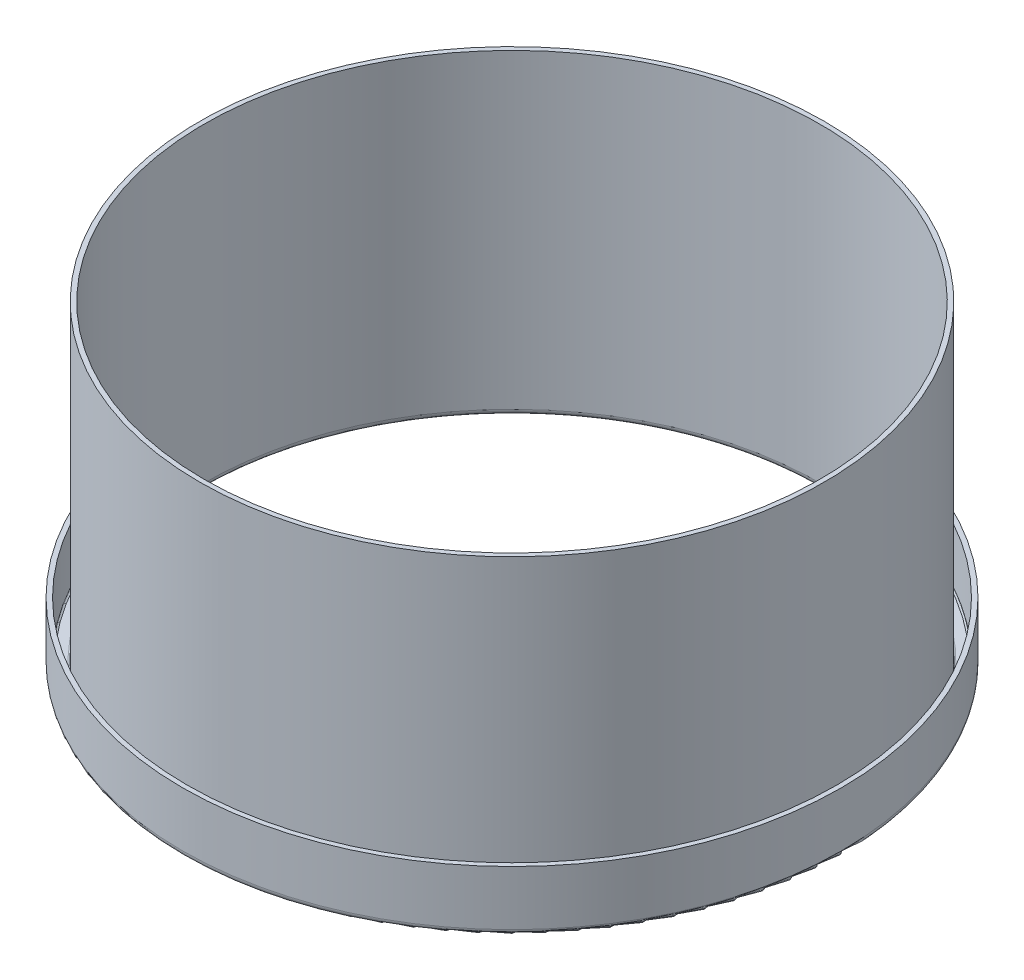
ISO-10303-21;
HEADER;
FILE_DESCRIPTION(('STEP AP214'),'2;1');
FILE_NAME('part.step','',(''),(''),'','','');
FILE_SCHEMA(('AUTOMOTIVE_DESIGN { 1 0 10303 214 1 1 1 1 }'));
ENDSEC;
DATA;
#1=APPLICATION_CONTEXT('core data for automotive mechanical design processes');
#2=APPLICATION_PROTOCOL_DEFINITION('international standard','automotive_design',2000,#1);
#3=PRODUCT_CONTEXT('',#1,'mechanical');
#4=PRODUCT('Part','Part','',(#3));
#5=PRODUCT_RELATED_PRODUCT_CATEGORY('part','',(#4));
#6=PRODUCT_DEFINITION_FORMATION('','',#4);
#7=PRODUCT_DEFINITION_CONTEXT('part definition',#1,'design');
#8=PRODUCT_DEFINITION('design','',#6,#7);
#9=PRODUCT_DEFINITION_SHAPE('','',#8);
#10=(LENGTH_UNIT() NAMED_UNIT(*) SI_UNIT(.MILLI.,.METRE.));
#11=(NAMED_UNIT(*) PLANE_ANGLE_UNIT() SI_UNIT($,.RADIAN.));
#12=(NAMED_UNIT(*) SI_UNIT($,.STERADIAN.) SOLID_ANGLE_UNIT());
#13=UNCERTAINTY_MEASURE_WITH_UNIT(LENGTH_MEASURE(1.E-05),#10,'distance_accuracy_value','');
#14=(GEOMETRIC_REPRESENTATION_CONTEXT(3) GLOBAL_UNCERTAINTY_ASSIGNED_CONTEXT((#13)) GLOBAL_UNIT_ASSIGNED_CONTEXT((#10,
#11,#12)) REPRESENTATION_CONTEXT('',''));
#15=CARTESIAN_POINT('',(0.,0.,0.));
#16=DIRECTION('',(0.,0.,1.));
#17=DIRECTION('',(1.,0.,0.));
#18=AXIS2_PLACEMENT_3D('',#15,#16,#17);
#19=CARTESIAN_POINT('',(0.,0.7366,0.));
#20=DIRECTION('',(0.,1.,0.));
#21=DIRECTION('',(0.,0.,1.));
#22=AXIS2_PLACEMENT_3D('',#19,#20,#21);
#23=PLANE('',#22);
#24=CARTESIAN_POINT('',(0.,0.7366,0.));
#25=DIRECTION('',(0.,1.,0.));
#26=DIRECTION('',(0.,0.,1.));
#27=AXIS2_PLACEMENT_3D('',#24,#25,#26);
#28=CIRCLE('',#27,50.25);
#29=CARTESIAN_POINT('',(0.,0.7366,50.25));
#30=VERTEX_POINT('',#29);
#31=EDGE_CURVE('E146',#30,#30,#28,.T.);
#32=ORIENTED_EDGE('',*,*,#31,.F.);
#33=EDGE_LOOP('',(#32));
#34=FACE_BOUND('',#33,.T.);
#35=CARTESIAN_POINT('',(0.,0.7366,0.));
#36=DIRECTION('',(0.,1.,0.));
#37=DIRECTION('',(0.,0.,1.));
#38=AXIS2_PLACEMENT_3D('',#35,#36,#37);
#39=CIRCLE('',#38,51.75);
#40=CARTESIAN_POINT('',(0.,0.7366,51.75));
#41=VERTEX_POINT('',#40);
#42=EDGE_CURVE('E196',#41,#41,#39,.T.);
#43=ORIENTED_EDGE('',*,*,#42,.T.);
#44=EDGE_LOOP('',(#43));
#45=FACE_BOUND('',#44,.T.);
#46=ADVANCED_FACE('F137',(#34,#45),#23,.T.);
#47=CARTESIAN_POINT('',(0.,0.,0.));
#48=DIRECTION('',(0.,1.,0.));
#49=DIRECTION('',(0.,0.,1.));
#50=AXIS2_PLACEMENT_3D('',#47,#48,#49);
#51=PLANE('',#50);
#52=CARTESIAN_POINT('',(0.,0.,0.));
#53=DIRECTION('',(0.,1.,0.));
#54=DIRECTION('',(0.,0.,1.));
#55=AXIS2_PLACEMENT_3D('',#52,#53,#54);
#56=CIRCLE('',#55,50.25);
#57=CARTESIAN_POINT('',(0.,0.,50.25));
#58=VERTEX_POINT('',#57);
#59=EDGE_CURVE('E221',#58,#58,#56,.T.);
#60=ORIENTED_EDGE('',*,*,#59,.T.);
#61=EDGE_LOOP('',(#60));
#62=FACE_BOUND('',#61,.T.);
#63=CARTESIAN_POINT('',(0.,0.,0.));
#64=DIRECTION('',(0.,1.,0.));
#65=DIRECTION('',(0.,0.,1.));
#66=AXIS2_PLACEMENT_3D('',#63,#64,#65);
#67=CIRCLE('',#66,51.75);
#68=CARTESIAN_POINT('',(0.,0.,51.75));
#69=VERTEX_POINT('',#68);
#70=EDGE_CURVE('E12',#69,#69,#67,.T.);
#71=ORIENTED_EDGE('',*,*,#70,.F.);
#72=EDGE_LOOP('',(#71));
#73=FACE_BOUND('',#72,.T.);
#74=ADVANCED_FACE('F139',(#62,#73),#51,.F.);
#75=CARTESIAN_POINT('',(0.,50.7366,0.));
#76=DIRECTION('',(0.,-1.,0.));
#77=DIRECTION('',(0.,0.,-1.));
#78=AXIS2_PLACEMENT_3D('',#75,#76,#77);
#79=PLANE('',#78);
#80=CARTESIAN_POINT('',(0.,50.7366,0.));
#81=DIRECTION('',(0.,1.,0.));
#82=DIRECTION('',(0.,0.,1.));
#83=AXIS2_PLACEMENT_3D('',#80,#81,#82);
#84=CIRCLE('',#83,50.0000000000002);
#85=CARTESIAN_POINT('',(0.,50.7366,50.0000000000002));
#86=VERTEX_POINT('',#85);
#87=EDGE_CURVE('E231',#86,#86,#84,.T.);
#88=ORIENTED_EDGE('',*,*,#87,.T.);
#89=EDGE_LOOP('',(#88));
#90=FACE_BOUND('',#89,.T.);
#91=CARTESIAN_POINT('',(0.,50.7366,0.));
#92=DIRECTION('',(0.,1.,0.));
#93=DIRECTION('',(0.,0.,1.));
#94=AXIS2_PLACEMENT_3D('',#91,#92,#93);
#95=CIRCLE('',#94,49.2634000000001);
#96=CARTESIAN_POINT('',(0.,50.7366,49.2634000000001));
#97=VERTEX_POINT('',#96);
#98=EDGE_CURVE('E224',#97,#97,#95,.T.);
#99=ORIENTED_EDGE('',*,*,#98,.F.);
#100=EDGE_LOOP('',(#99));
#101=FACE_BOUND('',#100,.T.);
#102=ADVANCED_FACE('F289',(#90,#101),#79,.F.);
#103=CARTESIAN_POINT('',(0.,0.7366,0.));
#104=DIRECTION('',(0.,1.,0.));
#105=DIRECTION('',(0.,0.,1.));
#106=AXIS2_PLACEMENT_3D('',#103,#104,#105);
#107=CYLINDRICAL_SURFACE('',#106,49.2634000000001);
#108=DIRECTION('',(0.,1.,0.));
#109=VECTOR('',#108,1.);
#110=CARTESIAN_POINT('',(0.,0.7366,49.2634000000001));
#111=LINE('',#110,#109);
#112=CARTESIAN_POINT('',(0.,0.986600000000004,49.2634));
#113=VERTEX_POINT('',#112);
#114=EDGE_CURVE('E218',#113,#97,#111,.T.);
#115=ORIENTED_EDGE('',*,*,#114,.F.);
#116=CARTESIAN_POINT('',(0.,0.986600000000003,0.));
#117=DIRECTION('',(0.,1.,0.));
#118=DIRECTION('',(0.,0.,1.));
#119=AXIS2_PLACEMENT_3D('',#116,#117,#118);
#120=CIRCLE('',#119,49.2634);
#121=EDGE_CURVE('E222',#113,#113,#120,.T.);
#122=ORIENTED_EDGE('',*,*,#121,.F.);
#123=ORIENTED_EDGE('',*,*,#114,.T.);
#124=ORIENTED_EDGE('',*,*,#98,.T.);
#125=EDGE_LOOP('',(#115,#122,#123,#124));
#126=FACE_BOUND('',#125,.T.);
#127=ADVANCED_FACE('F296',(#126),#107,.F.);
#128=CARTESIAN_POINT('',(0.,0.9866,0.));
#129=DIRECTION('',(0.,1.,0.));
#130=DIRECTION('',(0.,0.,1.));
#131=AXIS2_PLACEMENT_3D('',#128,#129,#130);
#132=TOROIDAL_SURFACE('',#131,50.25,0.9866);
#133=CARTESIAN_POINT('',(0.,0.9866,50.25));
#134=DIRECTION('',(-1.,0.,0.));
#135=DIRECTION('',(0.,0.,1.));
#136=AXIS2_PLACEMENT_3D('',#133,#134,#135);
#137=CIRCLE('',#136,0.9866);
#138=EDGE_CURVE('E161',#58,#113,#137,.F.);
#139=ORIENTED_EDGE('',*,*,#138,.F.);
#140=ORIENTED_EDGE('',*,*,#59,.F.);
#141=ORIENTED_EDGE('',*,*,#138,.T.);
#142=ORIENTED_EDGE('',*,*,#121,.T.);
#143=EDGE_LOOP('',(#139,#140,#141,#142));
#144=FACE_BOUND('',#143,.T.);
#145=ADVANCED_FACE('F291',(#144),#132,.T.);
#146=CARTESIAN_POINT('',(0.,0.7366,0.));
#147=DIRECTION('',(0.,1.,0.));
#148=DIRECTION('',(0.,0.,1.));
#149=AXIS2_PLACEMENT_3D('',#146,#147,#148);
#150=CYLINDRICAL_SURFACE('',#149,50.0000000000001);
#151=DIRECTION('',(0.,1.,0.));
#152=VECTOR('',#151,1.);
#153=CARTESIAN_POINT('',(0.,0.7366,50.));
#154=LINE('',#153,#152);
#155=CARTESIAN_POINT('',(0.,0.986600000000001,50.));
#156=VERTEX_POINT('',#155);
#157=EDGE_CURVE('E232',#156,#86,#154,.T.);
#158=ORIENTED_EDGE('',*,*,#157,.T.);
#159=ORIENTED_EDGE('',*,*,#87,.F.);
#160=ORIENTED_EDGE('',*,*,#157,.F.);
#161=CARTESIAN_POINT('',(0.,0.986600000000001,0.));
#162=DIRECTION('',(0.,1.,0.));
#163=DIRECTION('',(0.,0.,1.));
#164=AXIS2_PLACEMENT_3D('',#161,#162,#163);
#165=CIRCLE('',#164,50.);
#166=EDGE_CURVE('E228',#156,#156,#165,.T.);
#167=ORIENTED_EDGE('',*,*,#166,.T.);
#168=EDGE_LOOP('',(#158,#159,#160,#167));
#169=FACE_BOUND('',#168,.T.);
#170=ADVANCED_FACE('F281',(#169),#150,.T.);
#171=CARTESIAN_POINT('',(0.,0.9866,0.));
#172=DIRECTION('',(0.,1.,0.));
#173=DIRECTION('',(0.,0.,1.));
#174=AXIS2_PLACEMENT_3D('',#171,#172,#173);
#175=TOROIDAL_SURFACE('',#174,50.25,0.25);
#176=CARTESIAN_POINT('',(0.,0.9866,50.25));
#177=DIRECTION('',(-1.,0.,0.));
#178=DIRECTION('',(0.,-1.,0.));
#179=AXIS2_PLACEMENT_3D('',#176,#177,#178);
#180=CIRCLE('',#179,0.25);
#181=EDGE_CURVE('E217',#30,#156,#180,.F.);
#182=ORIENTED_EDGE('',*,*,#181,.T.);
#183=ORIENTED_EDGE('',*,*,#166,.F.);
#184=ORIENTED_EDGE('',*,*,#181,.F.);
#185=ORIENTED_EDGE('',*,*,#31,.T.);
#186=EDGE_LOOP('',(#182,#183,#184,#185));
#187=FACE_BOUND('',#186,.T.);
#188=ADVANCED_FACE('F272',(#187),#175,.F.);
#189=CARTESIAN_POINT('',(0.,9.73659999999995,0.));
#190=DIRECTION('',(0.,-1.,0.));
#191=DIRECTION('',(0.,0.,-1.));
#192=AXIS2_PLACEMENT_3D('',#189,#190,#191);
#193=PLANE('',#192);
#194=CARTESIAN_POINT('',(0.,9.73659999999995,0.));
#195=DIRECTION('',(0.,1.,0.));
#196=DIRECTION('',(0.,0.,1.));
#197=AXIS2_PLACEMENT_3D('',#194,#195,#196);
#198=CIRCLE('',#197,52.7366);
#199=CARTESIAN_POINT('',(0.,9.73659999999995,52.7366));
#200=VERTEX_POINT('',#199);
#201=EDGE_CURVE('E213',#200,#200,#198,.T.);
#202=ORIENTED_EDGE('',*,*,#201,.T.);
#203=EDGE_LOOP('',(#202));
#204=FACE_BOUND('',#203,.T.);
#205=CARTESIAN_POINT('',(0.,9.73659999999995,0.));
#206=DIRECTION('',(0.,1.,0.));
#207=DIRECTION('',(0.,0.,1.));
#208=AXIS2_PLACEMENT_3D('',#205,#206,#207);
#209=CIRCLE('',#208,52.);
#210=CARTESIAN_POINT('',(0.,9.73659999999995,52.));
#211=VERTEX_POINT('',#210);
#212=EDGE_CURVE('E195',#211,#211,#209,.T.);
#213=ORIENTED_EDGE('',*,*,#212,.F.);
#214=EDGE_LOOP('',(#213));
#215=FACE_BOUND('',#214,.T.);
#216=ADVANCED_FACE('F267',(#204,#215),#193,.F.);
#217=CARTESIAN_POINT('',(0.,0.7366,0.));
#218=DIRECTION('',(0.,1.,0.));
#219=DIRECTION('',(0.,0.,1.));
#220=AXIS2_PLACEMENT_3D('',#217,#218,#219);
#221=CYLINDRICAL_SURFACE('',#220,52.);
#222=DIRECTION('',(0.,1.,0.));
#223=VECTOR('',#222,1.);
#224=CARTESIAN_POINT('',(0.,0.7366,52.));
#225=LINE('',#224,#223);
#226=CARTESIAN_POINT('',(0.,0.986600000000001,52.));
#227=VERTEX_POINT('',#226);
#228=EDGE_CURVE('E202',#227,#211,#225,.T.);
#229=ORIENTED_EDGE('',*,*,#228,.F.);
#230=CARTESIAN_POINT('',(0.,0.986600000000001,0.));
#231=DIRECTION('',(0.,1.,0.));
#232=DIRECTION('',(0.,0.,1.));
#233=AXIS2_PLACEMENT_3D('',#230,#231,#232);
#234=CIRCLE('',#233,52.);
#235=EDGE_CURVE('E190',#227,#227,#234,.T.);
#236=ORIENTED_EDGE('',*,*,#235,.F.);
#237=ORIENTED_EDGE('',*,*,#228,.T.);
#238=ORIENTED_EDGE('',*,*,#212,.T.);
#239=EDGE_LOOP('',(#229,#236,#237,#238));
#240=FACE_BOUND('',#239,.T.);
#241=ADVANCED_FACE('F269',(#240),#221,.F.);
#242=CARTESIAN_POINT('',(0.,0.9866,0.));
#243=DIRECTION('',(0.,1.,0.));
#244=DIRECTION('',(0.,0.,1.));
#245=AXIS2_PLACEMENT_3D('',#242,#243,#244);
#246=TOROIDAL_SURFACE('',#245,51.75,0.25);
#247=CARTESIAN_POINT('',(0.,0.9866,51.75));
#248=DIRECTION('',(1.,0.,0.));
#249=DIRECTION('',(0.,1.,0.));
#250=AXIS2_PLACEMENT_3D('',#247,#248,#249);
#251=CIRCLE('',#250,0.25);
#252=EDGE_CURVE('E154',#41,#227,#251,.F.);
#253=ORIENTED_EDGE('',*,*,#252,.F.);
#254=ORIENTED_EDGE('',*,*,#42,.F.);
#255=ORIENTED_EDGE('',*,*,#252,.T.);
#256=ORIENTED_EDGE('',*,*,#235,.T.);
#257=EDGE_LOOP('',(#253,#254,#255,#256));
#258=FACE_BOUND('',#257,.T.);
#259=ADVANCED_FACE('F191',(#258),#246,.F.);
#260=CARTESIAN_POINT('',(0.,0.7366,0.));
#261=DIRECTION('',(0.,1.,0.));
#262=DIRECTION('',(0.,0.,1.));
#263=AXIS2_PLACEMENT_3D('',#260,#261,#262);
#264=CYLINDRICAL_SURFACE('',#263,52.7366);
#265=DIRECTION('',(0.,1.,0.));
#266=VECTOR('',#265,1.);
#267=CARTESIAN_POINT('',(0.,0.7366,52.7366));
#268=LINE('',#267,#266);
#269=CARTESIAN_POINT('',(0.,0.986600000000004,52.7366));
#270=VERTEX_POINT('',#269);
#271=EDGE_CURVE('E206',#270,#200,#268,.T.);
#272=ORIENTED_EDGE('',*,*,#271,.T.);
#273=ORIENTED_EDGE('',*,*,#201,.F.);
#274=ORIENTED_EDGE('',*,*,#271,.F.);
#275=CARTESIAN_POINT('',(0.,0.986600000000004,0.));
#276=DIRECTION('',(0.,1.,0.));
#277=DIRECTION('',(0.,0.,1.));
#278=AXIS2_PLACEMENT_3D('',#275,#276,#277);
#279=CIRCLE('',#278,52.7366);
#280=EDGE_CURVE('E209',#270,#270,#279,.T.);
#281=ORIENTED_EDGE('',*,*,#280,.T.);
#282=EDGE_LOOP('',(#272,#273,#274,#281));
#283=FACE_BOUND('',#282,.T.);
#284=ADVANCED_FACE('F264',(#283),#264,.T.);
#285=CARTESIAN_POINT('',(0.,0.9866,0.));
#286=DIRECTION('',(0.,1.,0.));
#287=DIRECTION('',(0.,0.,1.));
#288=AXIS2_PLACEMENT_3D('',#285,#286,#287);
#289=TOROIDAL_SURFACE('',#288,51.75,0.9866);
#290=CARTESIAN_POINT('',(0.,0.9866,51.75));
#291=DIRECTION('',(-1.,0.,0.));
#292=DIRECTION('',(0.,0.,1.));
#293=AXIS2_PLACEMENT_3D('',#290,#291,#292);
#294=CIRCLE('',#293,0.9866);
#295=EDGE_CURVE('E210',#69,#270,#294,.T.);
#296=ORIENTED_EDGE('',*,*,#295,.T.);
#297=ORIENTED_EDGE('',*,*,#280,.F.);
#298=ORIENTED_EDGE('',*,*,#295,.F.);
#299=ORIENTED_EDGE('',*,*,#70,.T.);
#300=EDGE_LOOP('',(#296,#297,#298,#299));
#301=FACE_BOUND('',#300,.T.);
#302=ADVANCED_FACE('F261',(#301),#289,.T.);
#303=CLOSED_SHELL('',(#46,#74,#102,#127,#145,#170,#188,#216,#241,#259,#284,#302));
#304=MANIFOLD_SOLID_BREP('B2',#303);
#305=ADVANCED_BREP_SHAPE_REPRESENTATION('',(#18,#304),#14);
#306=SHAPE_DEFINITION_REPRESENTATION(#9,#305);
ENDSEC;
END-ISO-10303-21;
